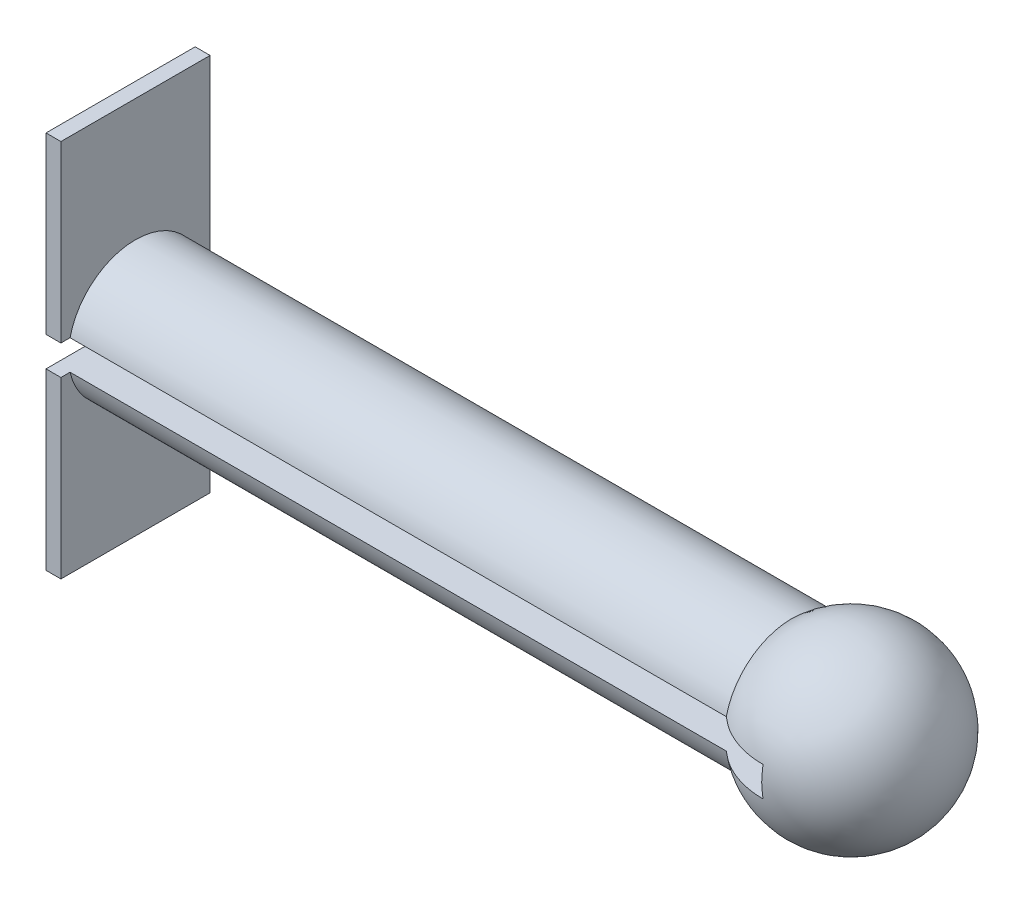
ISO-10303-21;
HEADER;
FILE_DESCRIPTION(('STEP AP214'),'2;1');
FILE_NAME('part.step','',(''),(''),'','','');
FILE_SCHEMA(('AUTOMOTIVE_DESIGN { 1 0 10303 214 1 1 1 1 }'));
ENDSEC;
DATA;
#1=APPLICATION_CONTEXT('core data for automotive mechanical design processes');
#2=APPLICATION_PROTOCOL_DEFINITION('international standard','automotive_design',2000,#1);
#3=PRODUCT_CONTEXT('',#1,'mechanical');
#4=PRODUCT('Part','Part','',(#3));
#5=PRODUCT_RELATED_PRODUCT_CATEGORY('part','',(#4));
#6=PRODUCT_DEFINITION_FORMATION('','',#4);
#7=PRODUCT_DEFINITION_CONTEXT('part definition',#1,'design');
#8=PRODUCT_DEFINITION('design','',#6,#7);
#9=PRODUCT_DEFINITION_SHAPE('','',#8);
#10=(LENGTH_UNIT() NAMED_UNIT(*) SI_UNIT(.MILLI.,.METRE.));
#11=(NAMED_UNIT(*) PLANE_ANGLE_UNIT() SI_UNIT($,.RADIAN.));
#12=(NAMED_UNIT(*) SI_UNIT($,.STERADIAN.) SOLID_ANGLE_UNIT());
#13=UNCERTAINTY_MEASURE_WITH_UNIT(LENGTH_MEASURE(1.E-05),#10,'distance_accuracy_value','');
#14=(GEOMETRIC_REPRESENTATION_CONTEXT(3) GLOBAL_UNCERTAINTY_ASSIGNED_CONTEXT((#13)) GLOBAL_UNIT_ASSIGNED_CONTEXT((#10,
#11,#12)) REPRESENTATION_CONTEXT('',''));
#15=CARTESIAN_POINT('',(0.,0.,0.));
#16=DIRECTION('',(0.,0.,1.));
#17=DIRECTION('',(1.,0.,0.));
#18=AXIS2_PLACEMENT_3D('',#15,#16,#17);
#19=CARTESIAN_POINT('',(20.,0.,0.));
#20=DIRECTION('',(1.,0.,0.));
#21=DIRECTION('',(0.,0.,-1.));
#22=AXIS2_PLACEMENT_3D('',#19,#20,#21);
#23=CYLINDRICAL_SURFACE('',#22,2.25);
#24=DIRECTION('',(1.,0.,0.));
#25=VECTOR('',#24,1.);
#26=CARTESIAN_POINT('',(20.,0.5,2.19374109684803));
#27=LINE('',#26,#25);
#28=CARTESIAN_POINT('',(22.,0.5,2.19374109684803));
#29=VERTEX_POINT('',#28);
#30=CARTESIAN_POINT('',(0.,0.5,2.19374109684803));
#31=VERTEX_POINT('',#30);
#32=EDGE_CURVE('E171',#29,#31,#27,.F.);
#33=ORIENTED_EDGE('',*,*,#32,.F.);
#34=CARTESIAN_POINT('',(22.,0.,0.));
#35=DIRECTION('',(1.,0.,0.));
#36=DIRECTION('',(0.,0.,-1.));
#37=AXIS2_PLACEMENT_3D('',#34,#35,#36);
#38=CIRCLE('',#37,2.25);
#39=CARTESIAN_POINT('',(22.,0.5,-2.19374109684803));
#40=VERTEX_POINT('',#39);
#41=EDGE_CURVE('E211',#40,#29,#38,.T.);
#42=ORIENTED_EDGE('',*,*,#41,.F.);
#43=DIRECTION('',(1.,0.,0.));
#44=VECTOR('',#43,1.);
#45=CARTESIAN_POINT('',(20.,0.5,-2.19374109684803));
#46=LINE('',#45,#44);
#47=CARTESIAN_POINT('',(0.,0.5,-2.19374109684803));
#48=VERTEX_POINT('',#47);
#49=EDGE_CURVE('E164',#48,#40,#46,.T.);
#50=ORIENTED_EDGE('',*,*,#49,.F.);
#51=CARTESIAN_POINT('',(0.,0.,0.));
#52=DIRECTION('',(1.,0.,0.));
#53=DIRECTION('',(0.,0.,-1.));
#54=AXIS2_PLACEMENT_3D('',#51,#52,#53);
#55=CIRCLE('',#54,2.25);
#56=EDGE_CURVE('E208',#48,#31,#55,.T.);
#57=ORIENTED_EDGE('',*,*,#56,.T.);
#58=EDGE_LOOP('',(#33,#42,#50,#57));
#59=FACE_BOUND('',#58,.T.);
#60=ADVANCED_FACE('F24',(#59),#23,.T.);
#61=CARTESIAN_POINT('',(-0.5,-6.35,2.5));
#62=DIRECTION('',(1.,0.,0.));
#63=DIRECTION('',(0.,0.,-1.));
#64=AXIS2_PLACEMENT_3D('',#61,#62,#63);
#65=PLANE('',#64);
#66=DIRECTION('',(0.,-1.,0.));
#67=VECTOR('',#66,1.);
#68=CARTESIAN_POINT('',(-0.5,-6.35,-2.5));
#69=LINE('',#68,#67);
#70=CARTESIAN_POINT('',(-0.5,6.35,-2.5));
#71=VERTEX_POINT('',#70);
#72=CARTESIAN_POINT('',(-0.5,0.5,-2.5));
#73=VERTEX_POINT('',#72);
#74=EDGE_CURVE('E173',#71,#73,#69,.T.);
#75=ORIENTED_EDGE('',*,*,#74,.T.);
#76=DIRECTION('',(0.,0.,1.));
#77=VECTOR('',#76,1.);
#78=CARTESIAN_POINT('',(-0.5,0.5,2.5));
#79=LINE('',#78,#77);
#80=CARTESIAN_POINT('',(-0.5,0.5,2.5));
#81=VERTEX_POINT('',#80);
#82=EDGE_CURVE('E154',#73,#81,#79,.T.);
#83=ORIENTED_EDGE('',*,*,#82,.T.);
#84=DIRECTION('',(0.,-1.,0.));
#85=VECTOR('',#84,1.);
#86=CARTESIAN_POINT('',(-0.5,-6.35,2.5));
#87=LINE('',#86,#85);
#88=CARTESIAN_POINT('',(-0.5,6.35,2.5));
#89=VERTEX_POINT('',#88);
#90=EDGE_CURVE('E186',#89,#81,#87,.T.);
#91=ORIENTED_EDGE('',*,*,#90,.F.);
#92=DIRECTION('',(0.,0.,-1.));
#93=VECTOR('',#92,1.);
#94=CARTESIAN_POINT('',(-0.5,6.35,2.5));
#95=LINE('',#94,#93);
#96=EDGE_CURVE('E195',#89,#71,#95,.T.);
#97=ORIENTED_EDGE('',*,*,#96,.T.);
#98=EDGE_LOOP('',(#75,#83,#91,#97));
#99=FACE_BOUND('',#98,.T.);
#100=ADVANCED_FACE('F256',(#99),#65,.F.);
#101=CARTESIAN_POINT('',(0.,-6.35,2.5));
#102=DIRECTION('',(-1.,0.,0.));
#103=DIRECTION('',(0.,-1.,0.));
#104=AXIS2_PLACEMENT_3D('',#101,#102,#103);
#105=PLANE('',#104);
#106=DIRECTION('',(0.,1.,0.));
#107=VECTOR('',#106,1.);
#108=CARTESIAN_POINT('',(0.,-6.35,2.5));
#109=LINE('',#108,#107);
#110=CARTESIAN_POINT('',(0.,0.5,2.5));
#111=VERTEX_POINT('',#110);
#112=CARTESIAN_POINT('',(0.,6.35,2.5));
#113=VERTEX_POINT('',#112);
#114=EDGE_CURVE('E190',#111,#113,#109,.T.);
#115=ORIENTED_EDGE('',*,*,#114,.F.);
#116=DIRECTION('',(0.,0.,-1.));
#117=VECTOR('',#116,1.);
#118=CARTESIAN_POINT('',(0.,0.5,2.5));
#119=LINE('',#118,#117);
#120=EDGE_CURVE('E156',#111,#31,#119,.T.);
#121=ORIENTED_EDGE('',*,*,#120,.T.);
#122=ORIENTED_EDGE('',*,*,#56,.F.);
#123=CARTESIAN_POINT('',(0.,0.5,-2.5));
#124=VERTEX_POINT('',#123);
#125=EDGE_CURVE('E151',#48,#124,#119,.T.);
#126=ORIENTED_EDGE('',*,*,#125,.T.);
#127=DIRECTION('',(0.,1.,0.));
#128=VECTOR('',#127,1.);
#129=CARTESIAN_POINT('',(0.,-6.35,-2.5));
#130=LINE('',#129,#128);
#131=CARTESIAN_POINT('',(0.,6.35,-2.5));
#132=VERTEX_POINT('',#131);
#133=EDGE_CURVE('E179',#124,#132,#130,.T.);
#134=ORIENTED_EDGE('',*,*,#133,.T.);
#135=DIRECTION('',(0.,0.,-1.));
#136=VECTOR('',#135,1.);
#137=CARTESIAN_POINT('',(0.,6.35,2.5));
#138=LINE('',#137,#136);
#139=EDGE_CURVE('E198',#113,#132,#138,.T.);
#140=ORIENTED_EDGE('',*,*,#139,.F.);
#141=EDGE_LOOP('',(#115,#121,#122,#126,#134,#140));
#142=FACE_BOUND('',#141,.T.);
#143=ADVANCED_FACE('F263',(#142),#105,.F.);
#144=CARTESIAN_POINT('',(-0.5,-6.35,2.5));
#145=DIRECTION('',(0.,0.,1.));
#146=DIRECTION('',(1.,0.,0.));
#147=AXIS2_PLACEMENT_3D('',#144,#145,#146);
#148=PLANE('',#147);
#149=DIRECTION('',(-1.,0.,0.));
#150=VECTOR('',#149,1.);
#151=CARTESIAN_POINT('',(-0.5,0.5,2.5));
#152=LINE('',#151,#150);
#153=EDGE_CURVE('E168',#111,#81,#152,.T.);
#154=ORIENTED_EDGE('',*,*,#153,.F.);
#155=ORIENTED_EDGE('',*,*,#114,.T.);
#156=DIRECTION('',(-1.,0.,0.));
#157=VECTOR('',#156,1.);
#158=CARTESIAN_POINT('',(0.,6.35,2.5));
#159=LINE('',#158,#157);
#160=EDGE_CURVE('E47',#113,#89,#159,.T.);
#161=ORIENTED_EDGE('',*,*,#160,.T.);
#162=ORIENTED_EDGE('',*,*,#90,.T.);
#163=EDGE_LOOP('',(#154,#155,#161,#162));
#164=FACE_BOUND('',#163,.T.);
#165=ADVANCED_FACE('F272',(#164),#148,.T.);
#166=CARTESIAN_POINT('',(-0.5,-6.35,-2.5));
#167=DIRECTION('',(0.,0.,1.));
#168=DIRECTION('',(1.,0.,0.));
#169=AXIS2_PLACEMENT_3D('',#166,#167,#168);
#170=PLANE('',#169);
#171=ORIENTED_EDGE('',*,*,#133,.F.);
#172=DIRECTION('',(-1.,0.,0.));
#173=VECTOR('',#172,1.);
#174=CARTESIAN_POINT('',(-0.5,0.5,-2.5));
#175=LINE('',#174,#173);
#176=EDGE_CURVE('E215',#124,#73,#175,.T.);
#177=ORIENTED_EDGE('',*,*,#176,.T.);
#178=ORIENTED_EDGE('',*,*,#74,.F.);
#179=DIRECTION('',(-1.,0.,0.));
#180=VECTOR('',#179,1.);
#181=CARTESIAN_POINT('',(0.,6.35,-2.5));
#182=LINE('',#181,#180);
#183=EDGE_CURVE('E183',#132,#71,#182,.T.);
#184=ORIENTED_EDGE('',*,*,#183,.F.);
#185=EDGE_LOOP('',(#171,#177,#178,#184));
#186=FACE_BOUND('',#185,.T.);
#187=ADVANCED_FACE('F257',(#186),#170,.F.);
#188=CARTESIAN_POINT('',(23.99375,0.,0.));
#189=DIRECTION('',(0.,0.,1.));
#190=DIRECTION('',(1.,0.,0.));
#191=AXIS2_PLACEMENT_3D('',#188,#189,#190);
#192=SPHERICAL_SURFACE('',#191,3.00625000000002);
#193=CARTESIAN_POINT('',(23.99375,0.5,0.));
#194=DIRECTION('',(0.,1.,0.));
#195=DIRECTION('',(0.,0.,1.));
#196=AXIS2_PLACEMENT_3D('',#193,#194,#195);
#197=CIRCLE('',#196,2.96437836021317);
#198=CARTESIAN_POINT('',(24.,0.5,-2.96437177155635));
#199=VERTEX_POINT('',#198);
#200=EDGE_CURVE('E166',#40,#199,#197,.F.);
#201=ORIENTED_EDGE('',*,*,#200,.F.);
#202=ORIENTED_EDGE('',*,*,#41,.T.);
#203=CARTESIAN_POINT('',(24.,0.5,2.96437177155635));
#204=VERTEX_POINT('',#203);
#205=EDGE_CURVE('E169',#204,#29,#197,.F.);
#206=ORIENTED_EDGE('',*,*,#205,.F.);
#207=CARTESIAN_POINT('',(24.,0.,0.));
#208=DIRECTION('',(1.,0.,0.));
#209=DIRECTION('',(0.,0.,-1.));
#210=AXIS2_PLACEMENT_3D('',#207,#208,#209);
#211=CIRCLE('',#210,3.0062435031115);
#212=CARTESIAN_POINT('',(24.,-0.5,2.96437177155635));
#213=VERTEX_POINT('',#212);
#214=EDGE_CURVE('E28',#213,#204,#211,.F.);
#215=ORIENTED_EDGE('',*,*,#214,.F.);
#216=CARTESIAN_POINT('',(23.99375,-0.5,0.));
#217=DIRECTION('',(0.,-1.,0.));
#218=DIRECTION('',(0.,0.,-1.));
#219=AXIS2_PLACEMENT_3D('',#216,#217,#218);
#220=CIRCLE('',#219,2.96437836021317);
#221=CARTESIAN_POINT('',(22.,-0.5,2.19374109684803));
#222=VERTEX_POINT('',#221);
#223=EDGE_CURVE('E139',#222,#213,#220,.F.);
#224=ORIENTED_EDGE('',*,*,#223,.F.);
#225=CARTESIAN_POINT('',(22.,-0.5,-2.19374109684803));
#226=VERTEX_POINT('',#225);
#227=EDGE_CURVE('E143',#222,#226,#38,.T.);
#228=ORIENTED_EDGE('',*,*,#227,.T.);
#229=CARTESIAN_POINT('',(24.,-0.5,-2.96437177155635));
#230=VERTEX_POINT('',#229);
#231=EDGE_CURVE('E136',#230,#226,#220,.F.);
#232=ORIENTED_EDGE('',*,*,#231,.F.);
#233=EDGE_CURVE('E11',#199,#230,#211,.F.);
#234=ORIENTED_EDGE('',*,*,#233,.F.);
#235=EDGE_LOOP('',(#201,#202,#206,#215,#224,#228,#232,#234));
#236=FACE_BOUND('',#235,.T.);
#237=ADVANCED_FACE('F26',(#236),#192,.T.);
#238=DIRECTION('',(1.,0.,0.));
#239=VECTOR('',#238,1.);
#240=CARTESIAN_POINT('',(20.,-0.5,-2.19374109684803));
#241=LINE('',#240,#239);
#242=CARTESIAN_POINT('',(0.,-0.5,-2.19374109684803));
#243=VERTEX_POINT('',#242);
#244=EDGE_CURVE('E145',#226,#243,#241,.F.);
#245=ORIENTED_EDGE('',*,*,#244,.F.);
#246=ORIENTED_EDGE('',*,*,#227,.F.);
#247=DIRECTION('',(1.,0.,0.));
#248=VECTOR('',#247,1.);
#249=CARTESIAN_POINT('',(20.,-0.5,2.19374109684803));
#250=LINE('',#249,#248);
#251=CARTESIAN_POINT('',(0.,-0.5,2.19374109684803));
#252=VERTEX_POINT('',#251);
#253=EDGE_CURVE('E152',#252,#222,#250,.T.);
#254=ORIENTED_EDGE('',*,*,#253,.F.);
#255=EDGE_CURVE('E207',#252,#243,#55,.T.);
#256=ORIENTED_EDGE('',*,*,#255,.T.);
#257=EDGE_LOOP('',(#245,#246,#254,#256));
#258=FACE_BOUND('',#257,.T.);
#259=ADVANCED_FACE('F249',(#258),#23,.T.);
#260=CARTESIAN_POINT('',(-0.5,-0.5,2.5));
#261=VERTEX_POINT('',#260);
#262=CARTESIAN_POINT('',(-0.5,-6.35,2.5));
#263=VERTEX_POINT('',#262);
#264=EDGE_CURVE('E185',#261,#263,#87,.T.);
#265=ORIENTED_EDGE('',*,*,#264,.F.);
#266=DIRECTION('',(0.,0.,-1.));
#267=VECTOR('',#266,1.);
#268=CARTESIAN_POINT('',(-0.5,-0.5,2.5));
#269=LINE('',#268,#267);
#270=CARTESIAN_POINT('',(-0.5,-0.5,-2.5));
#271=VERTEX_POINT('',#270);
#272=EDGE_CURVE('E149',#261,#271,#269,.T.);
#273=ORIENTED_EDGE('',*,*,#272,.T.);
#274=CARTESIAN_POINT('',(-0.5,-6.35,-2.5));
#275=VERTEX_POINT('',#274);
#276=EDGE_CURVE('E177',#271,#275,#69,.T.);
#277=ORIENTED_EDGE('',*,*,#276,.T.);
#278=DIRECTION('',(0.,0.,-1.));
#279=VECTOR('',#278,1.);
#280=CARTESIAN_POINT('',(-0.5,-6.35,2.5));
#281=LINE('',#280,#279);
#282=EDGE_CURVE('E204',#263,#275,#281,.T.);
#283=ORIENTED_EDGE('',*,*,#282,.F.);
#284=EDGE_LOOP('',(#265,#273,#277,#283));
#285=FACE_BOUND('',#284,.T.);
#286=ADVANCED_FACE('F232',(#285),#65,.F.);
#287=CARTESIAN_POINT('',(0.,-6.35,2.5));
#288=DIRECTION('',(0.,1.,0.));
#289=DIRECTION('',(0.,0.,1.));
#290=AXIS2_PLACEMENT_3D('',#287,#288,#289);
#291=PLANE('',#290);
#292=DIRECTION('',(1.,0.,0.));
#293=VECTOR('',#292,1.);
#294=CARTESIAN_POINT('',(0.,-6.35,-2.5));
#295=LINE('',#294,#293);
#296=CARTESIAN_POINT('',(0.,-6.35,-2.5));
#297=VERTEX_POINT('',#296);
#298=EDGE_CURVE('E176',#275,#297,#295,.T.);
#299=ORIENTED_EDGE('',*,*,#298,.T.);
#300=DIRECTION('',(0.,0.,-1.));
#301=VECTOR('',#300,1.);
#302=CARTESIAN_POINT('',(0.,-6.35,2.5));
#303=LINE('',#302,#301);
#304=CARTESIAN_POINT('',(0.,-6.35,2.5));
#305=VERTEX_POINT('',#304);
#306=EDGE_CURVE('E201',#305,#297,#303,.T.);
#307=ORIENTED_EDGE('',*,*,#306,.F.);
#308=DIRECTION('',(1.,0.,0.));
#309=VECTOR('',#308,1.);
#310=CARTESIAN_POINT('',(0.,-6.35,2.5));
#311=LINE('',#310,#309);
#312=EDGE_CURVE('E188',#263,#305,#311,.T.);
#313=ORIENTED_EDGE('',*,*,#312,.F.);
#314=ORIENTED_EDGE('',*,*,#282,.T.);
#315=EDGE_LOOP('',(#299,#307,#313,#314));
#316=FACE_BOUND('',#315,.T.);
#317=ADVANCED_FACE('F239',(#316),#291,.F.);
#318=CARTESIAN_POINT('',(0.,-0.5,-2.5));
#319=VERTEX_POINT('',#318);
#320=EDGE_CURVE('E180',#297,#319,#130,.T.);
#321=ORIENTED_EDGE('',*,*,#320,.T.);
#322=DIRECTION('',(0.,0.,1.));
#323=VECTOR('',#322,1.);
#324=CARTESIAN_POINT('',(0.,-0.5,2.5));
#325=LINE('',#324,#323);
#326=EDGE_CURVE('E39',#319,#243,#325,.T.);
#327=ORIENTED_EDGE('',*,*,#326,.T.);
#328=ORIENTED_EDGE('',*,*,#255,.F.);
#329=CARTESIAN_POINT('',(0.,-0.5,2.5));
#330=VERTEX_POINT('',#329);
#331=EDGE_CURVE('E147',#252,#330,#325,.T.);
#332=ORIENTED_EDGE('',*,*,#331,.T.);
#333=EDGE_CURVE('E191',#305,#330,#109,.T.);
#334=ORIENTED_EDGE('',*,*,#333,.F.);
#335=ORIENTED_EDGE('',*,*,#306,.T.);
#336=EDGE_LOOP('',(#321,#327,#328,#332,#334,#335));
#337=FACE_BOUND('',#336,.T.);
#338=ADVANCED_FACE('F246',(#337),#105,.F.);
#339=CARTESIAN_POINT('',(0.,6.35,2.5));
#340=DIRECTION('',(0.,-1.,0.));
#341=DIRECTION('',(1.,0.,0.));
#342=AXIS2_PLACEMENT_3D('',#339,#340,#341);
#343=PLANE('',#342);
#344=ORIENTED_EDGE('',*,*,#183,.T.);
#345=ORIENTED_EDGE('',*,*,#96,.F.);
#346=ORIENTED_EDGE('',*,*,#160,.F.);
#347=ORIENTED_EDGE('',*,*,#139,.T.);
#348=EDGE_LOOP('',(#344,#345,#346,#347));
#349=FACE_BOUND('',#348,.T.);
#350=ADVANCED_FACE('F276',(#349),#343,.F.);
#351=DIRECTION('',(1.,0.,0.));
#352=VECTOR('',#351,1.);
#353=CARTESIAN_POINT('',(-0.5,-0.5,2.5));
#354=LINE('',#353,#352);
#355=EDGE_CURVE('E144',#261,#330,#354,.T.);
#356=ORIENTED_EDGE('',*,*,#355,.F.);
#357=ORIENTED_EDGE('',*,*,#264,.T.);
#358=ORIENTED_EDGE('',*,*,#312,.T.);
#359=ORIENTED_EDGE('',*,*,#333,.T.);
#360=EDGE_LOOP('',(#356,#357,#358,#359));
#361=FACE_BOUND('',#360,.T.);
#362=ADVANCED_FACE('F243',(#361),#148,.T.);
#363=ORIENTED_EDGE('',*,*,#276,.F.);
#364=DIRECTION('',(1.,0.,0.));
#365=VECTOR('',#364,1.);
#366=CARTESIAN_POINT('',(-0.5,-0.5,-2.5));
#367=LINE('',#366,#365);
#368=EDGE_CURVE('E214',#271,#319,#367,.T.);
#369=ORIENTED_EDGE('',*,*,#368,.T.);
#370=ORIENTED_EDGE('',*,*,#320,.F.);
#371=ORIENTED_EDGE('',*,*,#298,.F.);
#372=EDGE_LOOP('',(#363,#369,#370,#371));
#373=FACE_BOUND('',#372,.T.);
#374=ADVANCED_FACE('F235',(#373),#170,.F.);
#375=CARTESIAN_POINT('',(-8.,0.5,-25.));
#376=DIRECTION('',(0.,1.,0.));
#377=DIRECTION('',(0.,0.,1.));
#378=AXIS2_PLACEMENT_3D('',#375,#376,#377);
#379=PLANE('',#378);
#380=ORIENTED_EDGE('',*,*,#205,.T.);
#381=ORIENTED_EDGE('',*,*,#32,.T.);
#382=ORIENTED_EDGE('',*,*,#120,.F.);
#383=ORIENTED_EDGE('',*,*,#153,.T.);
#384=ORIENTED_EDGE('',*,*,#82,.F.);
#385=ORIENTED_EDGE('',*,*,#176,.F.);
#386=ORIENTED_EDGE('',*,*,#125,.F.);
#387=ORIENTED_EDGE('',*,*,#49,.T.);
#388=ORIENTED_EDGE('',*,*,#200,.T.);
#389=DIRECTION('',(0.,0.,1.));
#390=VECTOR('',#389,1.);
#391=CARTESIAN_POINT('',(24.,0.5,-25.));
#392=LINE('',#391,#390);
#393=EDGE_CURVE('E131',#199,#204,#392,.T.);
#394=ORIENTED_EDGE('',*,*,#393,.T.);
#395=EDGE_LOOP('',(#380,#381,#382,#383,#384,#385,#386,#387,#388,#394));
#396=FACE_BOUND('',#395,.T.);
#397=ADVANCED_FACE('F222',(#396),#379,.F.);
#398=CARTESIAN_POINT('',(24.,0.5,-25.));
#399=DIRECTION('',(1.,0.,0.));
#400=DIRECTION('',(0.,0.,-1.));
#401=AXIS2_PLACEMENT_3D('',#398,#399,#400);
#402=PLANE('',#401);
#403=ORIENTED_EDGE('',*,*,#214,.T.);
#404=ORIENTED_EDGE('',*,*,#393,.F.);
#405=ORIENTED_EDGE('',*,*,#233,.T.);
#406=DIRECTION('',(0.,0.,1.));
#407=VECTOR('',#406,1.);
#408=CARTESIAN_POINT('',(24.,-0.5,-25.));
#409=LINE('',#408,#407);
#410=EDGE_CURVE('E128',#230,#213,#409,.T.);
#411=ORIENTED_EDGE('',*,*,#410,.T.);
#412=EDGE_LOOP('',(#403,#404,#405,#411));
#413=FACE_BOUND('',#412,.T.);
#414=ADVANCED_FACE('F127',(#413),#402,.F.);
#415=CARTESIAN_POINT('',(-8.,-0.5,-25.));
#416=DIRECTION('',(0.,-1.,0.));
#417=DIRECTION('',(0.,0.,-1.));
#418=AXIS2_PLACEMENT_3D('',#415,#416,#417);
#419=PLANE('',#418);
#420=ORIENTED_EDGE('',*,*,#223,.T.);
#421=ORIENTED_EDGE('',*,*,#410,.F.);
#422=ORIENTED_EDGE('',*,*,#231,.T.);
#423=ORIENTED_EDGE('',*,*,#244,.T.);
#424=ORIENTED_EDGE('',*,*,#326,.F.);
#425=ORIENTED_EDGE('',*,*,#368,.F.);
#426=ORIENTED_EDGE('',*,*,#272,.F.);
#427=ORIENTED_EDGE('',*,*,#355,.T.);
#428=ORIENTED_EDGE('',*,*,#331,.F.);
#429=ORIENTED_EDGE('',*,*,#253,.T.);
#430=EDGE_LOOP('',(#420,#421,#422,#423,#424,#425,#426,#427,#428,#429));
#431=FACE_BOUND('',#430,.T.);
#432=ADVANCED_FACE('F135',(#431),#419,.F.);
#433=CLOSED_SHELL('',(#60,#100,#143,#165,#187,#237,#259,#286,#317,#338,#350,#362,#374,#397,#414,#432));
#434=MANIFOLD_SOLID_BREP('B2',#433);
#435=ADVANCED_BREP_SHAPE_REPRESENTATION('',(#18,#434),#14);
#436=SHAPE_DEFINITION_REPRESENTATION(#9,#435);
ENDSEC;
END-ISO-10303-21;
